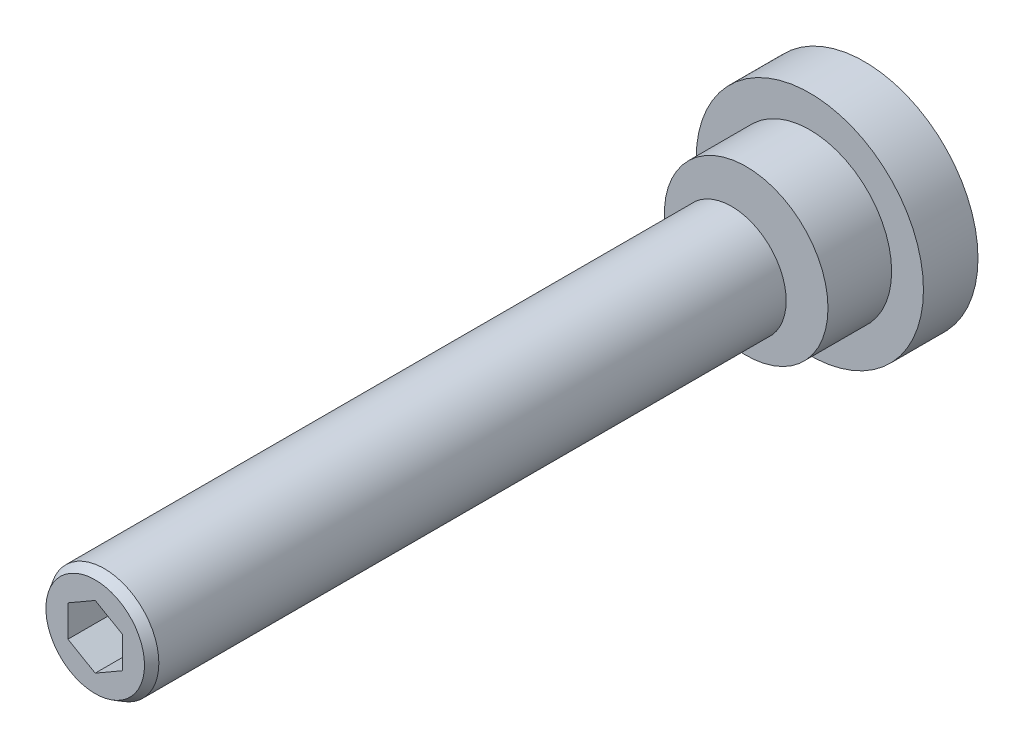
ISO-10303-21;
HEADER;
FILE_DESCRIPTION(('STEP AP214'),'2;1');
FILE_NAME('part.step','',(''),(''),'','','');
FILE_SCHEMA(('AUTOMOTIVE_DESIGN { 1 0 10303 214 1 1 1 1 }'));
ENDSEC;
DATA;
#1=APPLICATION_CONTEXT('core data for automotive mechanical design processes');
#2=APPLICATION_PROTOCOL_DEFINITION('international standard','automotive_design',2000,#1);
#3=PRODUCT_CONTEXT('',#1,'mechanical');
#4=PRODUCT('Part','Part','',(#3));
#5=PRODUCT_RELATED_PRODUCT_CATEGORY('part','',(#4));
#6=PRODUCT_DEFINITION_FORMATION('','',#4);
#7=PRODUCT_DEFINITION_CONTEXT('part definition',#1,'design');
#8=PRODUCT_DEFINITION('design','',#6,#7);
#9=PRODUCT_DEFINITION_SHAPE('','',#8);
#10=(LENGTH_UNIT() NAMED_UNIT(*) SI_UNIT(.MILLI.,.METRE.));
#11=(NAMED_UNIT(*) PLANE_ANGLE_UNIT() SI_UNIT($,.RADIAN.));
#12=(NAMED_UNIT(*) SI_UNIT($,.STERADIAN.) SOLID_ANGLE_UNIT());
#13=UNCERTAINTY_MEASURE_WITH_UNIT(LENGTH_MEASURE(1.E-05),#10,'distance_accuracy_value','');
#14=(GEOMETRIC_REPRESENTATION_CONTEXT(3) GLOBAL_UNCERTAINTY_ASSIGNED_CONTEXT((#13)) GLOBAL_UNIT_ASSIGNED_CONTEXT((#10,
#11,#12)) REPRESENTATION_CONTEXT('',''));
#15=CARTESIAN_POINT('',(0.,0.,0.));
#16=DIRECTION('',(0.,0.,1.));
#17=DIRECTION('',(1.,0.,0.));
#18=AXIS2_PLACEMENT_3D('',#15,#16,#17);
#19=CARTESIAN_POINT('',(-6.,0.,13.));
#20=DIRECTION('',(0.,0.,1.));
#21=DIRECTION('',(1.,0.,0.));
#22=AXIS2_PLACEMENT_3D('',#19,#20,#21);
#23=PLANE('',#22);
#24=CARTESIAN_POINT('',(0.,0.,13.));
#25=DIRECTION('',(0.,0.,1.));
#26=DIRECTION('',(1.,0.,0.));
#27=AXIS2_PLACEMENT_3D('',#24,#25,#26);
#28=CIRCLE('',#27,9.);
#29=CARTESIAN_POINT('',(9.,0.,13.));
#30=VERTEX_POINT('',#29);
#31=EDGE_CURVE('E131',#30,#30,#28,.T.);
#32=ORIENTED_EDGE('',*,*,#31,.T.);
#33=EDGE_LOOP('',(#32));
#34=FACE_BOUND('',#33,.T.);
#35=CARTESIAN_POINT('',(0.,0.,13.));
#36=DIRECTION('',(0.,0.,-1.));
#37=DIRECTION('',(-1.,0.,0.));
#38=AXIS2_PLACEMENT_3D('',#35,#36,#37);
#39=CIRCLE('',#38,3.6);
#40=CARTESIAN_POINT('',(-3.6,0.,13.));
#41=VERTEX_POINT('',#40);
#42=EDGE_CURVE('E314',#41,#41,#39,.T.);
#43=ORIENTED_EDGE('',*,*,#42,.T.);
#44=EDGE_LOOP('',(#43));
#45=FACE_BOUND('',#44,.T.);
#46=ADVANCED_FACE('F14',(#34,#45),#23,.T.);
#47=CARTESIAN_POINT('',(0.,0.,30.));
#48=DIRECTION('',(0.,0.,1.));
#49=DIRECTION('',(1.,0.,0.));
#50=AXIS2_PLACEMENT_3D('',#47,#48,#49);
#51=CYLINDRICAL_SURFACE('',#50,9.);
#52=CARTESIAN_POINT('',(0.,0.,6.));
#53=DIRECTION('',(0.,0.,1.));
#54=DIRECTION('',(1.,0.,0.));
#55=AXIS2_PLACEMENT_3D('',#52,#53,#54);
#56=CIRCLE('',#55,9.);
#57=CARTESIAN_POINT('',(9.,0.,6.));
#58=VERTEX_POINT('',#57);
#59=EDGE_CURVE('E128',#58,#58,#56,.T.);
#60=ORIENTED_EDGE('',*,*,#59,.T.);
#61=EDGE_LOOP('',(#60));
#62=FACE_BOUND('',#61,.T.);
#63=ORIENTED_EDGE('',*,*,#31,.F.);
#64=EDGE_LOOP('',(#63));
#65=FACE_BOUND('',#64,.T.);
#66=ADVANCED_FACE('F149',(#62,#65),#51,.T.);
#67=CARTESIAN_POINT('',(-9.,0.,6.));
#68=DIRECTION('',(0.,0.,1.));
#69=DIRECTION('',(1.,0.,0.));
#70=AXIS2_PLACEMENT_3D('',#67,#68,#69);
#71=PLANE('',#70);
#72=CARTESIAN_POINT('',(0.,0.,6.));
#73=DIRECTION('',(0.,0.,1.));
#74=DIRECTION('',(1.,0.,0.));
#75=AXIS2_PLACEMENT_3D('',#72,#73,#74);
#76=CIRCLE('',#75,12.5);
#77=CARTESIAN_POINT('',(12.5,0.,6.));
#78=VERTEX_POINT('',#77);
#79=EDGE_CURVE('E125',#78,#78,#76,.T.);
#80=ORIENTED_EDGE('',*,*,#79,.T.);
#81=EDGE_LOOP('',(#80));
#82=FACE_BOUND('',#81,.T.);
#83=ORIENTED_EDGE('',*,*,#59,.F.);
#84=EDGE_LOOP('',(#83));
#85=FACE_BOUND('',#84,.T.);
#86=ADVANCED_FACE('F156',(#82,#85),#71,.T.);
#87=CARTESIAN_POINT('',(0.,0.,30.));
#88=DIRECTION('',(0.,0.,1.));
#89=DIRECTION('',(1.,0.,0.));
#90=AXIS2_PLACEMENT_3D('',#87,#88,#89);
#91=CYLINDRICAL_SURFACE('',#90,12.5);
#92=CARTESIAN_POINT('',(0.,0.,0.));
#93=DIRECTION('',(0.,0.,1.));
#94=DIRECTION('',(1.,0.,0.));
#95=AXIS2_PLACEMENT_3D('',#92,#93,#94);
#96=CIRCLE('',#95,12.5);
#97=CARTESIAN_POINT('',(12.5,0.,0.));
#98=VERTEX_POINT('',#97);
#99=EDGE_CURVE('E116',#98,#98,#96,.T.);
#100=ORIENTED_EDGE('',*,*,#99,.T.);
#101=EDGE_LOOP('',(#100));
#102=FACE_BOUND('',#101,.T.);
#103=ORIENTED_EDGE('',*,*,#79,.F.);
#104=EDGE_LOOP('',(#103));
#105=FACE_BOUND('',#104,.T.);
#106=ADVANCED_FACE('F182',(#102,#105),#91,.T.);
#107=CARTESIAN_POINT('',(-12.5,0.,0.));
#108=DIRECTION('',(0.,0.,-1.));
#109=DIRECTION('',(-1.,0.,0.));
#110=AXIS2_PLACEMENT_3D('',#107,#108,#109);
#111=PLANE('',#110);
#112=ORIENTED_EDGE('',*,*,#99,.F.);
#113=EDGE_LOOP('',(#112));
#114=FACE_BOUND('',#113,.T.);
#115=ADVANCED_FACE('F178',(#114),#111,.T.);
#116=CARTESIAN_POINT('',(0.,0.,0.));
#117=DIRECTION('',(0.,0.,-1.));
#118=DIRECTION('',(-1.,0.,0.));
#119=AXIS2_PLACEMENT_3D('',#116,#117,#118);
#120=CYLINDRICAL_SURFACE('',#119,3.6);
#121=ORIENTED_EDGE('',*,*,#42,.F.);
#122=EDGE_LOOP('',(#121));
#123=FACE_BOUND('',#122,.T.);
#124=CARTESIAN_POINT('',(0.,0.,13.2143593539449));
#125=DIRECTION('',(0.,0.,-1.));
#126=DIRECTION('',(-1.,0.,0.));
#127=AXIS2_PLACEMENT_3D('',#124,#125,#126);
#128=CIRCLE('',#127,3.6);
#129=CARTESIAN_POINT('',(-3.6,0.,13.2143593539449));
#130=VERTEX_POINT('',#129);
#131=EDGE_CURVE('E316',#130,#130,#128,.T.);
#132=ORIENTED_EDGE('',*,*,#131,.T.);
#133=EDGE_LOOP('',(#132));
#134=FACE_BOUND('',#133,.T.);
#135=ADVANCED_FACE('F181',(#123,#134),#120,.T.);
#136=CARTESIAN_POINT('',(0.,0.,14.6));
#137=DIRECTION('',(0.,0.,1.));
#138=DIRECTION('',(1.,0.,0.));
#139=AXIS2_PLACEMENT_3D('',#136,#137,#138);
#140=CONICAL_SURFACE('',#139,6.,1.0471975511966);
#141=ORIENTED_EDGE('',*,*,#131,.F.);
#142=EDGE_LOOP('',(#141));
#143=FACE_BOUND('',#142,.T.);
#144=CARTESIAN_POINT('',(0.,0.,14.6));
#145=DIRECTION('',(0.,0.,-1.));
#146=DIRECTION('',(-1.,0.,0.));
#147=AXIS2_PLACEMENT_3D('',#144,#145,#146);
#148=CIRCLE('',#147,6.);
#149=CARTESIAN_POINT('',(-6.,0.,14.6));
#150=VERTEX_POINT('',#149);
#151=EDGE_CURVE('E321',#150,#150,#148,.T.);
#152=ORIENTED_EDGE('',*,*,#151,.T.);
#153=EDGE_LOOP('',(#152));
#154=FACE_BOUND('',#153,.T.);
#155=ADVANCED_FACE('F221',(#143,#154),#140,.T.);
#156=CARTESIAN_POINT('',(-3.,5.19615242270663,79.6));
#157=DIRECTION('',(0.,0.,1.));
#158=DIRECTION('',(1.,0.,0.));
#159=AXIS2_PLACEMENT_3D('',#156,#157,#158);
#160=PLANE('',#159);
#161=DIRECTION('',(-0.866025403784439,0.5,0.));
#162=VECTOR('',#161,1.);
#163=CARTESIAN_POINT('',(3.,1.73205080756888,79.6));
#164=LINE('',#163,#162);
#165=CARTESIAN_POINT('',(3.,1.73205080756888,79.6));
#166=VERTEX_POINT('',#165);
#167=CARTESIAN_POINT('',(0.,3.46410161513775,79.6));
#168=VERTEX_POINT('',#167);
#169=EDGE_CURVE('E100',#166,#168,#164,.T.);
#170=ORIENTED_EDGE('',*,*,#169,.T.);
#171=DIRECTION('',(-0.866025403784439,-0.5,0.));
#172=VECTOR('',#171,1.);
#173=CARTESIAN_POINT('',(0.,3.46410161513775,79.6));
#174=LINE('',#173,#172);
#175=CARTESIAN_POINT('',(-3.,1.73205080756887,79.6));
#176=VERTEX_POINT('',#175);
#177=EDGE_CURVE('E103',#168,#176,#174,.T.);
#178=ORIENTED_EDGE('',*,*,#177,.T.);
#179=DIRECTION('',(0.,-1.,0.));
#180=VECTOR('',#179,1.);
#181=CARTESIAN_POINT('',(-3.,1.73205080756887,79.6));
#182=LINE('',#181,#180);
#183=CARTESIAN_POINT('',(-3.,-1.73205080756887,79.6));
#184=VERTEX_POINT('',#183);
#185=EDGE_CURVE('E75',#176,#184,#182,.T.);
#186=ORIENTED_EDGE('',*,*,#185,.T.);
#187=DIRECTION('',(0.866025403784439,-0.5,0.));
#188=VECTOR('',#187,1.);
#189=CARTESIAN_POINT('',(-3.,-1.73205080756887,79.6));
#190=LINE('',#189,#188);
#191=CARTESIAN_POINT('',(0.,-3.46410161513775,79.6));
#192=VERTEX_POINT('',#191);
#193=EDGE_CURVE('E106',#184,#192,#190,.T.);
#194=ORIENTED_EDGE('',*,*,#193,.T.);
#195=DIRECTION('',(0.866025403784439,0.5,0.));
#196=VECTOR('',#195,1.);
#197=CARTESIAN_POINT('',(0.,-3.46410161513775,79.6));
#198=LINE('',#197,#196);
#199=CARTESIAN_POINT('',(3.,-1.73205080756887,79.6));
#200=VERTEX_POINT('',#199);
#201=EDGE_CURVE('E109',#192,#200,#198,.T.);
#202=ORIENTED_EDGE('',*,*,#201,.T.);
#203=DIRECTION('',(0.,1.,0.));
#204=VECTOR('',#203,1.);
#205=CARTESIAN_POINT('',(3.,-1.73205080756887,79.6));
#206=LINE('',#205,#204);
#207=EDGE_CURVE('E112',#200,#166,#206,.T.);
#208=ORIENTED_EDGE('',*,*,#207,.T.);
#209=EDGE_LOOP('',(#170,#178,#186,#194,#202,#208));
#210=FACE_BOUND('',#209,.T.);
#211=ADVANCED_FACE('F230',(#210),#160,.T.);
#212=CARTESIAN_POINT('',(0.,3.46410161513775,79.6));
#213=DIRECTION('',(-0.5,0.866025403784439,0.));
#214=DIRECTION('',(-0.866025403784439,-0.5,0.));
#215=AXIS2_PLACEMENT_3D('',#212,#213,#214);
#216=PLANE('',#215);
#217=DIRECTION('',(-0.866025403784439,-0.5,0.));
#218=VECTOR('',#217,1.);
#219=CARTESIAN_POINT('',(0.,3.46410161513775,84.6));
#220=LINE('',#219,#218);
#221=CARTESIAN_POINT('',(0.,3.46410161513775,84.6));
#222=VERTEX_POINT('',#221);
#223=CARTESIAN_POINT('',(-3.,1.73205080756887,84.6));
#224=VERTEX_POINT('',#223);
#225=EDGE_CURVE('E83',#222,#224,#220,.T.);
#226=ORIENTED_EDGE('',*,*,#225,.T.);
#227=DIRECTION('',(0.,0.,1.));
#228=VECTOR('',#227,1.);
#229=CARTESIAN_POINT('',(-3.,1.73205080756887,79.6));
#230=LINE('',#229,#228);
#231=EDGE_CURVE('E68',#176,#224,#230,.T.);
#232=ORIENTED_EDGE('',*,*,#231,.F.);
#233=ORIENTED_EDGE('',*,*,#177,.F.);
#234=DIRECTION('',(0.,0.,1.));
#235=VECTOR('',#234,1.);
#236=CARTESIAN_POINT('',(0.,3.46410161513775,79.6));
#237=LINE('',#236,#235);
#238=EDGE_CURVE('E80',#168,#222,#237,.T.);
#239=ORIENTED_EDGE('',*,*,#238,.T.);
#240=EDGE_LOOP('',(#226,#232,#233,#239));
#241=FACE_BOUND('',#240,.T.);
#242=ADVANCED_FACE('F84',(#241),#216,.F.);
#243=CARTESIAN_POINT('',(-3.,1.73205080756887,79.6));
#244=DIRECTION('',(-1.,0.,0.));
#245=DIRECTION('',(0.,0.,1.));
#246=AXIS2_PLACEMENT_3D('',#243,#244,#245);
#247=PLANE('',#246);
#248=DIRECTION('',(0.,-1.,0.));
#249=VECTOR('',#248,1.);
#250=CARTESIAN_POINT('',(-3.,1.73205080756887,84.6));
#251=LINE('',#250,#249);
#252=CARTESIAN_POINT('',(-3.,-1.73205080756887,84.6));
#253=VERTEX_POINT('',#252);
#254=EDGE_CURVE('E72',#224,#253,#251,.T.);
#255=ORIENTED_EDGE('',*,*,#254,.T.);
#256=DIRECTION('',(0.,0.,1.));
#257=VECTOR('',#256,1.);
#258=CARTESIAN_POINT('',(-3.,-1.73205080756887,79.6));
#259=LINE('',#258,#257);
#260=EDGE_CURVE('E79',#184,#253,#259,.T.);
#261=ORIENTED_EDGE('',*,*,#260,.F.);
#262=ORIENTED_EDGE('',*,*,#185,.F.);
#263=ORIENTED_EDGE('',*,*,#231,.T.);
#264=EDGE_LOOP('',(#255,#261,#262,#263));
#265=FACE_BOUND('',#264,.T.);
#266=ADVANCED_FACE('F70',(#265),#247,.F.);
#267=CARTESIAN_POINT('',(-3.,-1.73205080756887,79.6));
#268=DIRECTION('',(-0.5,-0.866025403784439,0.));
#269=DIRECTION('',(0.866025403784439,-0.5,0.));
#270=AXIS2_PLACEMENT_3D('',#267,#268,#269);
#271=PLANE('',#270);
#272=DIRECTION('',(0.866025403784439,-0.5,0.));
#273=VECTOR('',#272,1.);
#274=CARTESIAN_POINT('',(-3.,-1.73205080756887,84.6));
#275=LINE('',#274,#273);
#276=CARTESIAN_POINT('',(0.,-3.46410161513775,84.6));
#277=VERTEX_POINT('',#276);
#278=EDGE_CURVE('E90',#253,#277,#275,.T.);
#279=ORIENTED_EDGE('',*,*,#278,.T.);
#280=DIRECTION('',(0.,0.,1.));
#281=VECTOR('',#280,1.);
#282=CARTESIAN_POINT('',(0.,-3.46410161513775,79.6));
#283=LINE('',#282,#281);
#284=EDGE_CURVE('E119',#192,#277,#283,.T.);
#285=ORIENTED_EDGE('',*,*,#284,.F.);
#286=ORIENTED_EDGE('',*,*,#193,.F.);
#287=ORIENTED_EDGE('',*,*,#260,.T.);
#288=EDGE_LOOP('',(#279,#285,#286,#287));
#289=FACE_BOUND('',#288,.T.);
#290=ADVANCED_FACE('F253',(#289),#271,.F.);
#291=CARTESIAN_POINT('',(0.,-3.46410161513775,79.6));
#292=DIRECTION('',(0.5,-0.866025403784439,0.));
#293=DIRECTION('',(0.866025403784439,0.5,0.));
#294=AXIS2_PLACEMENT_3D('',#291,#292,#293);
#295=PLANE('',#294);
#296=DIRECTION('',(0.866025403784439,0.5,0.));
#297=VECTOR('',#296,1.);
#298=CARTESIAN_POINT('',(0.,-3.46410161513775,84.6));
#299=LINE('',#298,#297);
#300=CARTESIAN_POINT('',(3.,-1.73205080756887,84.6));
#301=VERTEX_POINT('',#300);
#302=EDGE_CURVE('E92',#277,#301,#299,.T.);
#303=ORIENTED_EDGE('',*,*,#302,.T.);
#304=DIRECTION('',(0.,0.,1.));
#305=VECTOR('',#304,1.);
#306=CARTESIAN_POINT('',(3.,-1.73205080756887,79.6));
#307=LINE('',#306,#305);
#308=EDGE_CURVE('E117',#200,#301,#307,.T.);
#309=ORIENTED_EDGE('',*,*,#308,.F.);
#310=ORIENTED_EDGE('',*,*,#201,.F.);
#311=ORIENTED_EDGE('',*,*,#284,.T.);
#312=EDGE_LOOP('',(#303,#309,#310,#311));
#313=FACE_BOUND('',#312,.T.);
#314=ADVANCED_FACE('F173',(#313),#295,.F.);
#315=CARTESIAN_POINT('',(3.,-1.73205080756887,79.6));
#316=DIRECTION('',(1.,0.,0.));
#317=DIRECTION('',(0.,0.,-1.));
#318=AXIS2_PLACEMENT_3D('',#315,#316,#317);
#319=PLANE('',#318);
#320=DIRECTION('',(0.,1.,0.));
#321=VECTOR('',#320,1.);
#322=CARTESIAN_POINT('',(3.,-1.73205080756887,84.6));
#323=LINE('',#322,#321);
#324=CARTESIAN_POINT('',(3.,1.73205080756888,84.6));
#325=VERTEX_POINT('',#324);
#326=EDGE_CURVE('E98',#301,#325,#323,.T.);
#327=ORIENTED_EDGE('',*,*,#326,.T.);
#328=DIRECTION('',(0.,0.,1.));
#329=VECTOR('',#328,1.);
#330=CARTESIAN_POINT('',(3.,1.73205080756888,79.6));
#331=LINE('',#330,#329);
#332=EDGE_CURVE('E36',#166,#325,#331,.T.);
#333=ORIENTED_EDGE('',*,*,#332,.F.);
#334=ORIENTED_EDGE('',*,*,#207,.F.);
#335=ORIENTED_EDGE('',*,*,#308,.T.);
#336=EDGE_LOOP('',(#327,#333,#334,#335));
#337=FACE_BOUND('',#336,.T.);
#338=ADVANCED_FACE('F167',(#337),#319,.F.);
#339=CARTESIAN_POINT('',(3.,1.73205080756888,79.6));
#340=DIRECTION('',(0.5,0.866025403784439,0.));
#341=DIRECTION('',(-0.866025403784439,0.5,0.));
#342=AXIS2_PLACEMENT_3D('',#339,#340,#341);
#343=PLANE('',#342);
#344=DIRECTION('',(-0.866025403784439,0.5,0.));
#345=VECTOR('',#344,1.);
#346=CARTESIAN_POINT('',(3.,1.73205080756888,84.6));
#347=LINE('',#346,#345);
#348=EDGE_CURVE('E29',#325,#222,#347,.T.);
#349=ORIENTED_EDGE('',*,*,#348,.T.);
#350=ORIENTED_EDGE('',*,*,#238,.F.);
#351=ORIENTED_EDGE('',*,*,#169,.F.);
#352=ORIENTED_EDGE('',*,*,#332,.T.);
#353=EDGE_LOOP('',(#349,#350,#351,#352));
#354=FACE_BOUND('',#353,.T.);
#355=ADVANCED_FACE('F162',(#354),#343,.F.);
#356=CARTESIAN_POINT('',(0.,0.,84.6));
#357=DIRECTION('',(0.,0.,1.));
#358=DIRECTION('',(1.,0.,0.));
#359=AXIS2_PLACEMENT_3D('',#356,#357,#358);
#360=PLANE('',#359);
#361=CARTESIAN_POINT('',(0.,0.,84.6));
#362=DIRECTION('',(0.,0.,1.));
#363=DIRECTION('',(1.,0.,0.));
#364=AXIS2_PLACEMENT_3D('',#361,#362,#363);
#365=CIRCLE('',#364,5.42264973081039);
#366=CARTESIAN_POINT('',(5.42264973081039,0.,84.6));
#367=VERTEX_POINT('',#366);
#368=EDGE_CURVE('E22',#367,#367,#365,.T.);
#369=ORIENTED_EDGE('',*,*,#368,.T.);
#370=EDGE_LOOP('',(#369));
#371=FACE_BOUND('',#370,.T.);
#372=ORIENTED_EDGE('',*,*,#348,.F.);
#373=ORIENTED_EDGE('',*,*,#326,.F.);
#374=ORIENTED_EDGE('',*,*,#302,.F.);
#375=ORIENTED_EDGE('',*,*,#278,.F.);
#376=ORIENTED_EDGE('',*,*,#254,.F.);
#377=ORIENTED_EDGE('',*,*,#225,.F.);
#378=EDGE_LOOP('',(#372,#373,#374,#375,#376,#377));
#379=FACE_BOUND('',#378,.T.);
#380=ADVANCED_FACE('F87',(#371,#379),#360,.T.);
#381=CARTESIAN_POINT('',(0.,0.,30.));
#382=DIRECTION('',(0.,0.,1.));
#383=DIRECTION('',(1.,0.,0.));
#384=AXIS2_PLACEMENT_3D('',#381,#382,#383);
#385=CYLINDRICAL_SURFACE('',#384,6.);
#386=CARTESIAN_POINT('',(0.,0.,83.6));
#387=DIRECTION('',(0.,0.,1.));
#388=DIRECTION('',(1.,0.,0.));
#389=AXIS2_PLACEMENT_3D('',#386,#387,#388);
#390=CIRCLE('',#389,6.);
#391=CARTESIAN_POINT('',(6.,0.,83.6));
#392=VERTEX_POINT('',#391);
#393=EDGE_CURVE('E9',#392,#392,#390,.F.);
#394=ORIENTED_EDGE('',*,*,#393,.T.);
#395=EDGE_LOOP('',(#394));
#396=FACE_BOUND('',#395,.T.);
#397=ORIENTED_EDGE('',*,*,#151,.F.);
#398=EDGE_LOOP('',(#397));
#399=FACE_BOUND('',#398,.T.);
#400=ADVANCED_FACE('F138',(#396,#399),#385,.T.);
#401=CARTESIAN_POINT('',(0.,0.,84.6));
#402=DIRECTION('',(0.,0.,-1.));
#403=DIRECTION('',(-1.,0.,0.));
#404=AXIS2_PLACEMENT_3D('',#401,#402,#403);
#405=CONICAL_SURFACE('',#404,5.42264973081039,0.523598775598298);
#406=ORIENTED_EDGE('',*,*,#393,.F.);
#407=EDGE_LOOP('',(#406));
#408=FACE_BOUND('',#407,.T.);
#409=ORIENTED_EDGE('',*,*,#368,.F.);
#410=EDGE_LOOP('',(#409));
#411=FACE_BOUND('',#410,.T.);
#412=ADVANCED_FACE('F16',(#408,#411),#405,.T.);
#413=CLOSED_SHELL('',(#46,#66,#86,#106,#115,#135,#155,#211,#242,#266,#290,#314,#338,#355,#380,
#400,#412));
#414=MANIFOLD_SOLID_BREP('B1',#413);
#415=ADVANCED_BREP_SHAPE_REPRESENTATION('',(#18,#414),#14);
#416=SHAPE_DEFINITION_REPRESENTATION(#9,#415);
ENDSEC;
END-ISO-10303-21;
